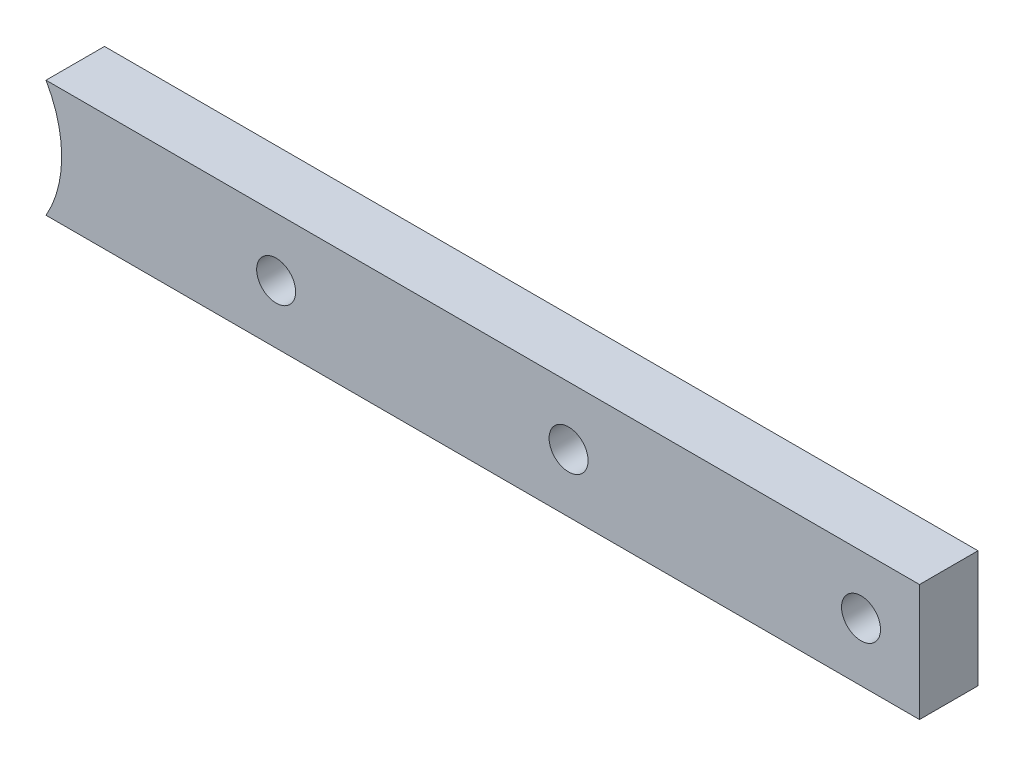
ISO-10303-21;
HEADER;
FILE_DESCRIPTION(('STEP AP214'),'2;1');
FILE_NAME('part.step','',(''),(''),'','','');
FILE_SCHEMA(('AUTOMOTIVE_DESIGN { 1 0 10303 214 1 1 1 1 }'));
ENDSEC;
DATA;
#1=APPLICATION_CONTEXT('core data for automotive mechanical design processes');
#2=APPLICATION_PROTOCOL_DEFINITION('international standard','automotive_design',2000,#1);
#3=PRODUCT_CONTEXT('',#1,'mechanical');
#4=PRODUCT('Part','Part','',(#3));
#5=PRODUCT_RELATED_PRODUCT_CATEGORY('part','',(#4));
#6=PRODUCT_DEFINITION_FORMATION('','',#4);
#7=PRODUCT_DEFINITION_CONTEXT('part definition',#1,'design');
#8=PRODUCT_DEFINITION('design','',#6,#7);
#9=PRODUCT_DEFINITION_SHAPE('','',#8);
#10=(LENGTH_UNIT() NAMED_UNIT(*) SI_UNIT(.MILLI.,.METRE.));
#11=(NAMED_UNIT(*) PLANE_ANGLE_UNIT() SI_UNIT($,.RADIAN.));
#12=(NAMED_UNIT(*) SI_UNIT($,.STERADIAN.) SOLID_ANGLE_UNIT());
#13=UNCERTAINTY_MEASURE_WITH_UNIT(LENGTH_MEASURE(1.E-05),#10,'distance_accuracy_value','');
#14=(GEOMETRIC_REPRESENTATION_CONTEXT(3) GLOBAL_UNCERTAINTY_ASSIGNED_CONTEXT((#13)) GLOBAL_UNIT_ASSIGNED_CONTEXT((#10,
#11,#12)) REPRESENTATION_CONTEXT('',''));
#15=CARTESIAN_POINT('',(0.,0.,0.));
#16=DIRECTION('',(0.,0.,1.));
#17=DIRECTION('',(1.,0.,0.));
#18=AXIS2_PLACEMENT_3D('',#15,#16,#17);
#19=CARTESIAN_POINT('',(0.,0.,30.));
#20=DIRECTION('',(0.,0.,1.));
#21=DIRECTION('',(1.,0.,0.));
#22=AXIS2_PLACEMENT_3D('',#19,#20,#21);
#23=PLANE('',#22);
#24=CARTESIAN_POINT('',(320.,0.,30.));
#25=DIRECTION('',(0.,0.,1.));
#26=DIRECTION('',(1.,0.,0.));
#27=AXIS2_PLACEMENT_3D('',#24,#25,#26);
#28=CIRCLE('',#27,9.99999999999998);
#29=CARTESIAN_POINT('',(330.,0.,30.));
#30=VERTEX_POINT('',#29);
#31=EDGE_CURVE('E127',#30,#30,#28,.T.);
#32=ORIENTED_EDGE('',*,*,#31,.F.);
#33=EDGE_LOOP('',(#32));
#34=FACE_BOUND('',#33,.T.);
#35=DIRECTION('',(0.,1.,0.));
#36=VECTOR('',#35,1.);
#37=CARTESIAN_POINT('',(500.,30.,30.));
#38=LINE('',#37,#36);
#39=CARTESIAN_POINT('',(500.,-30.,30.));
#40=VERTEX_POINT('',#39);
#41=CARTESIAN_POINT('',(500.,30.,30.));
#42=VERTEX_POINT('',#41);
#43=EDGE_CURVE('E101',#40,#42,#38,.T.);
#44=ORIENTED_EDGE('',*,*,#43,.T.);
#45=DIRECTION('',(-1.,0.,0.));
#46=VECTOR('',#45,1.);
#47=CARTESIAN_POINT('',(51.9615242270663,30.,30.));
#48=LINE('',#47,#46);
#49=CARTESIAN_POINT('',(51.9615242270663,30.,30.));
#50=VERTEX_POINT('',#49);
#51=EDGE_CURVE('E86',#42,#50,#48,.T.);
#52=ORIENTED_EDGE('',*,*,#51,.T.);
#53=CARTESIAN_POINT('',(0.,0.,30.));
#54=DIRECTION('',(0.,0.,-1.));
#55=DIRECTION('',(1.,0.,0.));
#56=AXIS2_PLACEMENT_3D('',#53,#54,#55);
#57=CIRCLE('',#56,60.);
#58=CARTESIAN_POINT('',(51.9615242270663,-30.,30.));
#59=VERTEX_POINT('',#58);
#60=EDGE_CURVE('E52',#50,#59,#57,.T.);
#61=ORIENTED_EDGE('',*,*,#60,.T.);
#62=DIRECTION('',(1.,0.,0.));
#63=VECTOR('',#62,1.);
#64=CARTESIAN_POINT('',(51.9615242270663,-30.,30.));
#65=LINE('',#64,#63);
#66=EDGE_CURVE('E47',#59,#40,#65,.T.);
#67=ORIENTED_EDGE('',*,*,#66,.T.);
#68=EDGE_LOOP('',(#44,#52,#61,#67));
#69=FACE_BOUND('',#68,.T.);
#70=CARTESIAN_POINT('',(470.,0.,30.));
#71=DIRECTION('',(0.,0.,1.));
#72=DIRECTION('',(1.,0.,0.));
#73=AXIS2_PLACEMENT_3D('',#70,#71,#72);
#74=CIRCLE('',#73,9.99999999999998);
#75=CARTESIAN_POINT('',(480.,0.,30.));
#76=VERTEX_POINT('',#75);
#77=EDGE_CURVE('E91',#76,#76,#74,.T.);
#78=ORIENTED_EDGE('',*,*,#77,.F.);
#79=EDGE_LOOP('',(#78));
#80=FACE_BOUND('',#79,.T.);
#81=CARTESIAN_POINT('',(170.,0.,30.));
#82=DIRECTION('',(0.,0.,1.));
#83=DIRECTION('',(1.,0.,0.));
#84=AXIS2_PLACEMENT_3D('',#81,#82,#83);
#85=CIRCLE('',#84,10.);
#86=CARTESIAN_POINT('',(180.,0.,30.));
#87=VERTEX_POINT('',#86);
#88=EDGE_CURVE('E121',#87,#87,#85,.T.);
#89=ORIENTED_EDGE('',*,*,#88,.F.);
#90=EDGE_LOOP('',(#89));
#91=FACE_BOUND('',#90,.T.);
#92=ADVANCED_FACE('F32',(#34,#69,#80,#91),#23,.T.);
#93=CARTESIAN_POINT('',(0.,0.,0.));
#94=DIRECTION('',(0.,0.,1.));
#95=DIRECTION('',(1.,0.,0.));
#96=AXIS2_PLACEMENT_3D('',#93,#94,#95);
#97=PLANE('',#96);
#98=CARTESIAN_POINT('',(320.,0.,0.));
#99=DIRECTION('',(0.,0.,1.));
#100=DIRECTION('',(1.,0.,0.));
#101=AXIS2_PLACEMENT_3D('',#98,#99,#100);
#102=CIRCLE('',#101,9.99999999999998);
#103=CARTESIAN_POINT('',(330.,0.,0.));
#104=VERTEX_POINT('',#103);
#105=EDGE_CURVE('E123',#104,#104,#102,.T.);
#106=ORIENTED_EDGE('',*,*,#105,.T.);
#107=EDGE_LOOP('',(#106));
#108=FACE_BOUND('',#107,.T.);
#109=DIRECTION('',(0.,1.,0.));
#110=VECTOR('',#109,1.);
#111=CARTESIAN_POINT('',(500.,30.,0.));
#112=LINE('',#111,#110);
#113=CARTESIAN_POINT('',(500.,-30.,0.));
#114=VERTEX_POINT('',#113);
#115=CARTESIAN_POINT('',(500.,30.,0.));
#116=VERTEX_POINT('',#115);
#117=EDGE_CURVE('E78',#114,#116,#112,.T.);
#118=ORIENTED_EDGE('',*,*,#117,.F.);
#119=DIRECTION('',(1.,0.,0.));
#120=VECTOR('',#119,1.);
#121=CARTESIAN_POINT('',(51.9615242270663,-30.,0.));
#122=LINE('',#121,#120);
#123=CARTESIAN_POINT('',(51.9615242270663,-30.,0.));
#124=VERTEX_POINT('',#123);
#125=EDGE_CURVE('E99',#124,#114,#122,.T.);
#126=ORIENTED_EDGE('',*,*,#125,.F.);
#127=CARTESIAN_POINT('',(0.,0.,0.));
#128=DIRECTION('',(0.,0.,-1.));
#129=DIRECTION('',(1.,0.,0.));
#130=AXIS2_PLACEMENT_3D('',#127,#128,#129);
#131=CIRCLE('',#130,60.);
#132=CARTESIAN_POINT('',(51.9615242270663,30.,0.));
#133=VERTEX_POINT('',#132);
#134=EDGE_CURVE('E79',#133,#124,#131,.T.);
#135=ORIENTED_EDGE('',*,*,#134,.F.);
#136=DIRECTION('',(-1.,0.,0.));
#137=VECTOR('',#136,1.);
#138=CARTESIAN_POINT('',(51.9615242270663,30.,0.));
#139=LINE('',#138,#137);
#140=EDGE_CURVE('E73',#116,#133,#139,.T.);
#141=ORIENTED_EDGE('',*,*,#140,.F.);
#142=EDGE_LOOP('',(#118,#126,#135,#141));
#143=FACE_BOUND('',#142,.T.);
#144=CARTESIAN_POINT('',(470.,0.,0.));
#145=DIRECTION('',(0.,0.,1.));
#146=DIRECTION('',(1.,0.,0.));
#147=AXIS2_PLACEMENT_3D('',#144,#145,#146);
#148=CIRCLE('',#147,9.99999999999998);
#149=CARTESIAN_POINT('',(480.,0.,0.));
#150=VERTEX_POINT('',#149);
#151=EDGE_CURVE('E94',#150,#150,#148,.T.);
#152=ORIENTED_EDGE('',*,*,#151,.T.);
#153=EDGE_LOOP('',(#152));
#154=FACE_BOUND('',#153,.T.);
#155=CARTESIAN_POINT('',(170.,0.,0.));
#156=DIRECTION('',(0.,0.,1.));
#157=DIRECTION('',(1.,0.,0.));
#158=AXIS2_PLACEMENT_3D('',#155,#156,#157);
#159=CIRCLE('',#158,10.);
#160=CARTESIAN_POINT('',(180.,0.,0.));
#161=VERTEX_POINT('',#160);
#162=EDGE_CURVE('E124',#161,#161,#159,.T.);
#163=ORIENTED_EDGE('',*,*,#162,.T.);
#164=EDGE_LOOP('',(#163));
#165=FACE_BOUND('',#164,.T.);
#166=ADVANCED_FACE('F74',(#108,#143,#154,#165),#97,.F.);
#167=CARTESIAN_POINT('',(500.,30.,30.));
#168=DIRECTION('',(-1.,0.,0.));
#169=DIRECTION('',(0.,0.,1.));
#170=AXIS2_PLACEMENT_3D('',#167,#168,#169);
#171=PLANE('',#170);
#172=ORIENTED_EDGE('',*,*,#117,.T.);
#173=DIRECTION('',(0.,0.,-1.));
#174=VECTOR('',#173,1.);
#175=CARTESIAN_POINT('',(500.,30.,30.));
#176=LINE('',#175,#174);
#177=EDGE_CURVE('E11',#42,#116,#176,.T.);
#178=ORIENTED_EDGE('',*,*,#177,.F.);
#179=ORIENTED_EDGE('',*,*,#43,.F.);
#180=DIRECTION('',(0.,0.,-1.));
#181=VECTOR('',#180,1.);
#182=CARTESIAN_POINT('',(500.,-30.,30.));
#183=LINE('',#182,#181);
#184=EDGE_CURVE('E90',#40,#114,#183,.T.);
#185=ORIENTED_EDGE('',*,*,#184,.T.);
#186=EDGE_LOOP('',(#172,#178,#179,#185));
#187=FACE_BOUND('',#186,.T.);
#188=ADVANCED_FACE('F34',(#187),#171,.F.);
#189=CARTESIAN_POINT('',(51.9615242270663,30.,30.));
#190=DIRECTION('',(0.,-1.,0.));
#191=DIRECTION('',(0.,0.,-1.));
#192=AXIS2_PLACEMENT_3D('',#189,#190,#191);
#193=PLANE('',#192);
#194=ORIENTED_EDGE('',*,*,#140,.T.);
#195=DIRECTION('',(0.,0.,-1.));
#196=VECTOR('',#195,1.);
#197=CARTESIAN_POINT('',(51.9615242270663,30.,30.));
#198=LINE('',#197,#196);
#199=EDGE_CURVE('E40',#50,#133,#198,.T.);
#200=ORIENTED_EDGE('',*,*,#199,.F.);
#201=ORIENTED_EDGE('',*,*,#51,.F.);
#202=ORIENTED_EDGE('',*,*,#177,.T.);
#203=EDGE_LOOP('',(#194,#200,#201,#202));
#204=FACE_BOUND('',#203,.T.);
#205=ADVANCED_FACE('F85',(#204),#193,.F.);
#206=CARTESIAN_POINT('',(0.,0.,30.));
#207=DIRECTION('',(0.,0.,-1.));
#208=DIRECTION('',(-1.,0.,0.));
#209=AXIS2_PLACEMENT_3D('',#206,#207,#208);
#210=CYLINDRICAL_SURFACE('',#209,60.);
#211=ORIENTED_EDGE('',*,*,#134,.T.);
#212=DIRECTION('',(0.,0.,-1.));
#213=VECTOR('',#212,1.);
#214=CARTESIAN_POINT('',(51.9615242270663,-30.,30.));
#215=LINE('',#214,#213);
#216=EDGE_CURVE('E107',#59,#124,#215,.T.);
#217=ORIENTED_EDGE('',*,*,#216,.F.);
#218=ORIENTED_EDGE('',*,*,#60,.F.);
#219=ORIENTED_EDGE('',*,*,#199,.T.);
#220=EDGE_LOOP('',(#211,#217,#218,#219));
#221=FACE_BOUND('',#220,.T.);
#222=ADVANCED_FACE('F110',(#221),#210,.F.);
#223=CARTESIAN_POINT('',(51.9615242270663,-30.,30.));
#224=DIRECTION('',(0.,1.,0.));
#225=DIRECTION('',(-1.,0.,0.));
#226=AXIS2_PLACEMENT_3D('',#223,#224,#225);
#227=PLANE('',#226);
#228=ORIENTED_EDGE('',*,*,#125,.T.);
#229=ORIENTED_EDGE('',*,*,#184,.F.);
#230=ORIENTED_EDGE('',*,*,#66,.F.);
#231=ORIENTED_EDGE('',*,*,#216,.T.);
#232=EDGE_LOOP('',(#228,#229,#230,#231));
#233=FACE_BOUND('',#232,.T.);
#234=ADVANCED_FACE('F112',(#233),#227,.F.);
#235=CARTESIAN_POINT('',(470.,0.,30.));
#236=DIRECTION('',(0.,0.,-1.));
#237=DIRECTION('',(-1.,0.,0.));
#238=AXIS2_PLACEMENT_3D('',#235,#236,#237);
#239=CYLINDRICAL_SURFACE('',#238,9.99999999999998);
#240=ORIENTED_EDGE('',*,*,#77,.T.);
#241=EDGE_LOOP('',(#240));
#242=FACE_BOUND('',#241,.T.);
#243=ORIENTED_EDGE('',*,*,#151,.F.);
#244=EDGE_LOOP('',(#243));
#245=FACE_BOUND('',#244,.T.);
#246=ADVANCED_FACE('F137',(#242,#245),#239,.F.);
#247=CARTESIAN_POINT('',(320.,0.,30.));
#248=DIRECTION('',(0.,0.,-1.));
#249=DIRECTION('',(-1.,0.,0.));
#250=AXIS2_PLACEMENT_3D('',#247,#248,#249);
#251=CYLINDRICAL_SURFACE('',#250,9.99999999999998);
#252=ORIENTED_EDGE('',*,*,#31,.T.);
#253=EDGE_LOOP('',(#252));
#254=FACE_BOUND('',#253,.T.);
#255=ORIENTED_EDGE('',*,*,#105,.F.);
#256=EDGE_LOOP('',(#255));
#257=FACE_BOUND('',#256,.T.);
#258=ADVANCED_FACE('F139',(#254,#257),#251,.F.);
#259=CARTESIAN_POINT('',(170.,0.,30.));
#260=DIRECTION('',(0.,0.,-1.));
#261=DIRECTION('',(-1.,0.,0.));
#262=AXIS2_PLACEMENT_3D('',#259,#260,#261);
#263=CYLINDRICAL_SURFACE('',#262,10.);
#264=ORIENTED_EDGE('',*,*,#88,.T.);
#265=EDGE_LOOP('',(#264));
#266=FACE_BOUND('',#265,.T.);
#267=ORIENTED_EDGE('',*,*,#162,.F.);
#268=EDGE_LOOP('',(#267));
#269=FACE_BOUND('',#268,.T.);
#270=ADVANCED_FACE('F146',(#266,#269),#263,.F.);
#271=CLOSED_SHELL('',(#92,#166,#188,#205,#222,#234,#246,#258,#270));
#272=MANIFOLD_SOLID_BREP('B2',#271);
#273=ADVANCED_BREP_SHAPE_REPRESENTATION('',(#18,#272),#14);
#274=SHAPE_DEFINITION_REPRESENTATION(#9,#273);
ENDSEC;
END-ISO-10303-21;
